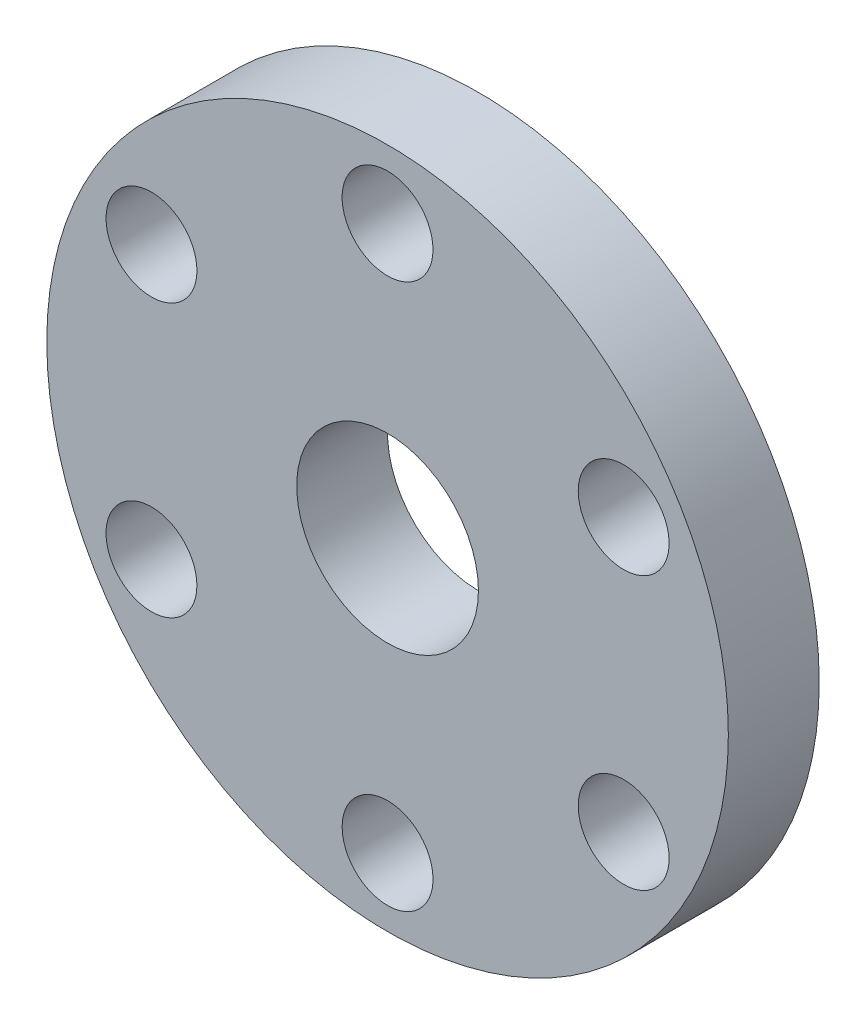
ISO-10303-21;
HEADER;
FILE_DESCRIPTION(('STEP AP214'),'2;1');
FILE_NAME('part.step','',(''),(''),'','','');
FILE_SCHEMA(('AUTOMOTIVE_DESIGN { 1 0 10303 214 1 1 1 1 }'));
ENDSEC;
DATA;
#1=APPLICATION_CONTEXT('core data for automotive mechanical design processes');
#2=APPLICATION_PROTOCOL_DEFINITION('international standard','automotive_design',2000,#1);
#3=PRODUCT_CONTEXT('',#1,'mechanical');
#4=PRODUCT('Part','Part','',(#3));
#5=PRODUCT_RELATED_PRODUCT_CATEGORY('part','',(#4));
#6=PRODUCT_DEFINITION_FORMATION('','',#4);
#7=PRODUCT_DEFINITION_CONTEXT('part definition',#1,'design');
#8=PRODUCT_DEFINITION('design','',#6,#7);
#9=PRODUCT_DEFINITION_SHAPE('','',#8);
#10=(LENGTH_UNIT() NAMED_UNIT(*) SI_UNIT(.MILLI.,.METRE.));
#11=(NAMED_UNIT(*) PLANE_ANGLE_UNIT() SI_UNIT($,.RADIAN.));
#12=(NAMED_UNIT(*) SI_UNIT($,.STERADIAN.) SOLID_ANGLE_UNIT());
#13=UNCERTAINTY_MEASURE_WITH_UNIT(LENGTH_MEASURE(1.E-05),#10,'distance_accuracy_value','');
#14=(GEOMETRIC_REPRESENTATION_CONTEXT(3) GLOBAL_UNCERTAINTY_ASSIGNED_CONTEXT((#13)) GLOBAL_UNIT_ASSIGNED_CONTEXT((#10,
#11,#12)) REPRESENTATION_CONTEXT('',''));
#15=CARTESIAN_POINT('',(0.,0.,0.));
#16=DIRECTION('',(0.,0.,1.));
#17=DIRECTION('',(1.,0.,0.));
#18=AXIS2_PLACEMENT_3D('',#15,#16,#17);
#19=CARTESIAN_POINT('',(0.,0.,20.));
#20=DIRECTION('',(0.,0.,1.));
#21=DIRECTION('',(1.,0.,0.));
#22=AXIS2_PLACEMENT_3D('',#19,#20,#21);
#23=PLANE('',#22);
#24=CARTESIAN_POINT('',(51.961524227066,30.0000000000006,20.));
#25=DIRECTION('',(0.,0.,1.));
#26=DIRECTION('',(0.50000000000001,-0.866025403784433,0.));
#27=AXIS2_PLACEMENT_3D('',#24,#25,#26);
#28=CIRCLE('',#27,10.);
#29=CARTESIAN_POINT('',(56.9615242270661,21.3397459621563,20.));
#30=VERTEX_POINT('',#29);
#31=EDGE_CURVE('E61',#30,#30,#28,.T.);
#32=ORIENTED_EDGE('',*,*,#31,.F.);
#33=EDGE_LOOP('',(#32));
#34=FACE_BOUND('',#33,.T.);
#35=CARTESIAN_POINT('',(51.9615242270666,-29.9999999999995,20.));
#36=DIRECTION('',(0.,0.,1.));
#37=DIRECTION('',(-0.499999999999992,-0.866025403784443,0.));
#38=AXIS2_PLACEMENT_3D('',#35,#36,#37);
#39=CIRCLE('',#38,10.);
#40=CARTESIAN_POINT('',(46.9615242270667,-38.6602540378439,20.));
#41=VERTEX_POINT('',#40);
#42=EDGE_CURVE('E67',#41,#41,#39,.T.);
#43=ORIENTED_EDGE('',*,*,#42,.F.);
#44=EDGE_LOOP('',(#43));
#45=FACE_BOUND('',#44,.T.);
#46=CARTESIAN_POINT('',(0.,-60.,20.));
#47=DIRECTION('',(0.,0.,1.));
#48=DIRECTION('',(-1.,0.,0.));
#49=AXIS2_PLACEMENT_3D('',#46,#47,#48);
#50=CIRCLE('',#49,10.);
#51=CARTESIAN_POINT('',(-10.,-60.,20.));
#52=VERTEX_POINT('',#51);
#53=EDGE_CURVE('E73',#52,#52,#50,.T.);
#54=ORIENTED_EDGE('',*,*,#53,.F.);
#55=EDGE_LOOP('',(#54));
#56=FACE_BOUND('',#55,.T.);
#57=CARTESIAN_POINT('',(-51.9615242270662,-30.0000000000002,20.));
#58=DIRECTION('',(0.,0.,1.));
#59=DIRECTION('',(-0.500000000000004,0.866025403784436,0.));
#60=AXIS2_PLACEMENT_3D('',#57,#58,#59);
#61=CIRCLE('',#60,10.);
#62=CARTESIAN_POINT('',(-56.9615242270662,-21.3397459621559,20.));
#63=VERTEX_POINT('',#62);
#64=EDGE_CURVE('E79',#63,#63,#61,.T.);
#65=ORIENTED_EDGE('',*,*,#64,.F.);
#66=EDGE_LOOP('',(#65));
#67=FACE_BOUND('',#66,.T.);
#68=CARTESIAN_POINT('',(-51.9615242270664,29.9999999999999,20.));
#69=DIRECTION('',(0.,0.,1.));
#70=DIRECTION('',(0.499999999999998,0.86602540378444,0.));
#71=AXIS2_PLACEMENT_3D('',#68,#69,#70);
#72=CIRCLE('',#71,10.);
#73=CARTESIAN_POINT('',(-46.9615242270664,38.6602540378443,20.));
#74=VERTEX_POINT('',#73);
#75=EDGE_CURVE('E55',#74,#74,#72,.T.);
#76=ORIENTED_EDGE('',*,*,#75,.F.);
#77=EDGE_LOOP('',(#76));
#78=FACE_BOUND('',#77,.T.);
#79=CARTESIAN_POINT('',(0.,60.,20.));
#80=DIRECTION('',(0.,0.,1.));
#81=DIRECTION('',(1.,0.,0.));
#82=AXIS2_PLACEMENT_3D('',#79,#80,#81);
#83=CIRCLE('',#82,10.);
#84=CARTESIAN_POINT('',(10.,60.,20.));
#85=VERTEX_POINT('',#84);
#86=EDGE_CURVE('E49',#85,#85,#83,.T.);
#87=ORIENTED_EDGE('',*,*,#86,.F.);
#88=EDGE_LOOP('',(#87));
#89=FACE_BOUND('',#88,.T.);
#90=CARTESIAN_POINT('',(0.,0.,20.));
#91=DIRECTION('',(0.,0.,1.));
#92=DIRECTION('',(1.,0.,0.));
#93=AXIS2_PLACEMENT_3D('',#90,#91,#92);
#94=CIRCLE('',#93,75.);
#95=CARTESIAN_POINT('',(75.,0.,20.));
#96=VERTEX_POINT('',#95);
#97=EDGE_CURVE('E10',#96,#96,#94,.T.);
#98=ORIENTED_EDGE('',*,*,#97,.T.);
#99=EDGE_LOOP('',(#98));
#100=FACE_BOUND('',#99,.T.);
#101=CARTESIAN_POINT('',(0.,0.,20.));
#102=DIRECTION('',(0.,0.,1.));
#103=DIRECTION('',(1.,0.,0.));
#104=AXIS2_PLACEMENT_3D('',#101,#102,#103);
#105=CIRCLE('',#104,20.);
#106=CARTESIAN_POINT('',(20.,0.,20.));
#107=VERTEX_POINT('',#106);
#108=EDGE_CURVE('E41',#107,#107,#105,.T.);
#109=ORIENTED_EDGE('',*,*,#108,.F.);
#110=EDGE_LOOP('',(#109));
#111=FACE_BOUND('',#110,.T.);
#112=ADVANCED_FACE('F30',(#34,#45,#56,#67,#78,#89,#100,#111),#23,.T.);
#113=CARTESIAN_POINT('',(0.,0.,0.));
#114=DIRECTION('',(0.,0.,1.));
#115=DIRECTION('',(1.,0.,0.));
#116=AXIS2_PLACEMENT_3D('',#113,#114,#115);
#117=PLANE('',#116);
#118=CARTESIAN_POINT('',(51.961524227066,30.0000000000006,0.));
#119=DIRECTION('',(0.,0.,1.));
#120=DIRECTION('',(0.50000000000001,-0.866025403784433,0.));
#121=AXIS2_PLACEMENT_3D('',#118,#119,#120);
#122=CIRCLE('',#121,10.);
#123=CARTESIAN_POINT('',(56.9615242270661,21.3397459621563,0.));
#124=VERTEX_POINT('',#123);
#125=EDGE_CURVE('E64',#124,#124,#122,.T.);
#126=ORIENTED_EDGE('',*,*,#125,.T.);
#127=EDGE_LOOP('',(#126));
#128=FACE_BOUND('',#127,.T.);
#129=CARTESIAN_POINT('',(51.9615242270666,-29.9999999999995,0.));
#130=DIRECTION('',(0.,0.,1.));
#131=DIRECTION('',(-0.499999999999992,-0.866025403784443,0.));
#132=AXIS2_PLACEMENT_3D('',#129,#130,#131);
#133=CIRCLE('',#132,10.);
#134=CARTESIAN_POINT('',(46.9615242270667,-38.6602540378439,0.));
#135=VERTEX_POINT('',#134);
#136=EDGE_CURVE('E70',#135,#135,#133,.T.);
#137=ORIENTED_EDGE('',*,*,#136,.T.);
#138=EDGE_LOOP('',(#137));
#139=FACE_BOUND('',#138,.T.);
#140=CARTESIAN_POINT('',(0.,-60.,0.));
#141=DIRECTION('',(0.,0.,1.));
#142=DIRECTION('',(-1.,0.,0.));
#143=AXIS2_PLACEMENT_3D('',#140,#141,#142);
#144=CIRCLE('',#143,10.);
#145=CARTESIAN_POINT('',(-10.,-60.,0.));
#146=VERTEX_POINT('',#145);
#147=EDGE_CURVE('E76',#146,#146,#144,.T.);
#148=ORIENTED_EDGE('',*,*,#147,.T.);
#149=EDGE_LOOP('',(#148));
#150=FACE_BOUND('',#149,.T.);
#151=CARTESIAN_POINT('',(-51.9615242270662,-30.0000000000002,0.));
#152=DIRECTION('',(0.,0.,1.));
#153=DIRECTION('',(-0.500000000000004,0.866025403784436,0.));
#154=AXIS2_PLACEMENT_3D('',#151,#152,#153);
#155=CIRCLE('',#154,10.);
#156=CARTESIAN_POINT('',(-56.9615242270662,-21.3397459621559,0.));
#157=VERTEX_POINT('',#156);
#158=EDGE_CURVE('E58',#157,#157,#155,.T.);
#159=ORIENTED_EDGE('',*,*,#158,.T.);
#160=EDGE_LOOP('',(#159));
#161=FACE_BOUND('',#160,.T.);
#162=CARTESIAN_POINT('',(-51.9615242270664,29.9999999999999,0.));
#163=DIRECTION('',(0.,0.,1.));
#164=DIRECTION('',(0.499999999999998,0.86602540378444,0.));
#165=AXIS2_PLACEMENT_3D('',#162,#163,#164);
#166=CIRCLE('',#165,10.);
#167=CARTESIAN_POINT('',(-46.9615242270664,38.6602540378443,0.));
#168=VERTEX_POINT('',#167);
#169=EDGE_CURVE('E52',#168,#168,#166,.T.);
#170=ORIENTED_EDGE('',*,*,#169,.T.);
#171=EDGE_LOOP('',(#170));
#172=FACE_BOUND('',#171,.T.);
#173=CARTESIAN_POINT('',(0.,60.,0.));
#174=DIRECTION('',(0.,0.,1.));
#175=DIRECTION('',(1.,0.,0.));
#176=AXIS2_PLACEMENT_3D('',#173,#174,#175);
#177=CIRCLE('',#176,10.);
#178=CARTESIAN_POINT('',(10.,60.,0.));
#179=VERTEX_POINT('',#178);
#180=EDGE_CURVE('E46',#179,#179,#177,.T.);
#181=ORIENTED_EDGE('',*,*,#180,.T.);
#182=EDGE_LOOP('',(#181));
#183=FACE_BOUND('',#182,.T.);
#184=CARTESIAN_POINT('',(0.,0.,0.));
#185=DIRECTION('',(0.,0.,1.));
#186=DIRECTION('',(1.,0.,0.));
#187=AXIS2_PLACEMENT_3D('',#184,#185,#186);
#188=CIRCLE('',#187,75.);
#189=CARTESIAN_POINT('',(75.,0.,0.));
#190=VERTEX_POINT('',#189);
#191=EDGE_CURVE('E34',#190,#190,#188,.T.);
#192=ORIENTED_EDGE('',*,*,#191,.F.);
#193=EDGE_LOOP('',(#192));
#194=FACE_BOUND('',#193,.T.);
#195=CARTESIAN_POINT('',(0.,0.,0.));
#196=DIRECTION('',(0.,0.,1.));
#197=DIRECTION('',(1.,0.,0.));
#198=AXIS2_PLACEMENT_3D('',#195,#196,#197);
#199=CIRCLE('',#198,20.);
#200=CARTESIAN_POINT('',(20.,0.,0.));
#201=VERTEX_POINT('',#200);
#202=EDGE_CURVE('E43',#201,#201,#199,.T.);
#203=ORIENTED_EDGE('',*,*,#202,.T.);
#204=EDGE_LOOP('',(#203));
#205=FACE_BOUND('',#204,.T.);
#206=ADVANCED_FACE('F85',(#128,#139,#150,#161,#172,#183,#194,#205),#117,.F.);
#207=CARTESIAN_POINT('',(0.,0.,20.));
#208=DIRECTION('',(0.,0.,-1.));
#209=DIRECTION('',(-1.,0.,0.));
#210=AXIS2_PLACEMENT_3D('',#207,#208,#209);
#211=CYLINDRICAL_SURFACE('',#210,75.);
#212=ORIENTED_EDGE('',*,*,#97,.F.);
#213=EDGE_LOOP('',(#212));
#214=FACE_BOUND('',#213,.T.);
#215=ORIENTED_EDGE('',*,*,#191,.T.);
#216=EDGE_LOOP('',(#215));
#217=FACE_BOUND('',#216,.T.);
#218=ADVANCED_FACE('F32',(#214,#217),#211,.T.);
#219=CARTESIAN_POINT('',(0.,0.,20.));
#220=DIRECTION('',(0.,0.,-1.));
#221=DIRECTION('',(-1.,0.,0.));
#222=AXIS2_PLACEMENT_3D('',#219,#220,#221);
#223=CYLINDRICAL_SURFACE('',#222,20.);
#224=ORIENTED_EDGE('',*,*,#108,.T.);
#225=EDGE_LOOP('',(#224));
#226=FACE_BOUND('',#225,.T.);
#227=ORIENTED_EDGE('',*,*,#202,.F.);
#228=EDGE_LOOP('',(#227));
#229=FACE_BOUND('',#228,.T.);
#230=ADVANCED_FACE('F106',(#226,#229),#223,.F.);
#231=CARTESIAN_POINT('',(0.,60.,0.));
#232=DIRECTION('',(0.,0.,1.));
#233=DIRECTION('',(1.,0.,0.));
#234=AXIS2_PLACEMENT_3D('',#231,#232,#233);
#235=CYLINDRICAL_SURFACE('',#234,10.);
#236=ORIENTED_EDGE('',*,*,#180,.F.);
#237=EDGE_LOOP('',(#236));
#238=FACE_BOUND('',#237,.T.);
#239=ORIENTED_EDGE('',*,*,#86,.T.);
#240=EDGE_LOOP('',(#239));
#241=FACE_BOUND('',#240,.T.);
#242=ADVANCED_FACE('F109',(#238,#241),#235,.F.);
#243=CARTESIAN_POINT('',(-51.9615242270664,29.9999999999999,0.));
#244=DIRECTION('',(0.,0.,1.));
#245=DIRECTION('',(1.,0.,0.));
#246=AXIS2_PLACEMENT_3D('',#243,#244,#245);
#247=CYLINDRICAL_SURFACE('',#246,10.);
#248=ORIENTED_EDGE('',*,*,#169,.F.);
#249=EDGE_LOOP('',(#248));
#250=FACE_BOUND('',#249,.T.);
#251=ORIENTED_EDGE('',*,*,#75,.T.);
#252=EDGE_LOOP('',(#251));
#253=FACE_BOUND('',#252,.T.);
#254=ADVANCED_FACE('F92',(#250,#253),#247,.F.);
#255=CARTESIAN_POINT('',(-51.9615242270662,-30.0000000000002,0.));
#256=DIRECTION('',(0.,0.,1.));
#257=DIRECTION('',(1.,0.,0.));
#258=AXIS2_PLACEMENT_3D('',#255,#256,#257);
#259=CYLINDRICAL_SURFACE('',#258,10.);
#260=ORIENTED_EDGE('',*,*,#158,.F.);
#261=EDGE_LOOP('',(#260));
#262=FACE_BOUND('',#261,.T.);
#263=ORIENTED_EDGE('',*,*,#64,.T.);
#264=EDGE_LOOP('',(#263));
#265=FACE_BOUND('',#264,.T.);
#266=ADVANCED_FACE('F88',(#262,#265),#259,.F.);
#267=CARTESIAN_POINT('',(0.,-60.,0.));
#268=DIRECTION('',(0.,0.,1.));
#269=DIRECTION('',(1.,0.,0.));
#270=AXIS2_PLACEMENT_3D('',#267,#268,#269);
#271=CYLINDRICAL_SURFACE('',#270,10.);
#272=ORIENTED_EDGE('',*,*,#147,.F.);
#273=EDGE_LOOP('',(#272));
#274=FACE_BOUND('',#273,.T.);
#275=ORIENTED_EDGE('',*,*,#53,.T.);
#276=EDGE_LOOP('',(#275));
#277=FACE_BOUND('',#276,.T.);
#278=ADVANCED_FACE('F91',(#274,#277),#271,.F.);
#279=CARTESIAN_POINT('',(51.9615242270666,-29.9999999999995,0.));
#280=DIRECTION('',(0.,0.,1.));
#281=DIRECTION('',(1.,0.,0.));
#282=AXIS2_PLACEMENT_3D('',#279,#280,#281);
#283=CYLINDRICAL_SURFACE('',#282,10.);
#284=ORIENTED_EDGE('',*,*,#136,.F.);
#285=EDGE_LOOP('',(#284));
#286=FACE_BOUND('',#285,.T.);
#287=ORIENTED_EDGE('',*,*,#42,.T.);
#288=EDGE_LOOP('',(#287));
#289=FACE_BOUND('',#288,.T.);
#290=ADVANCED_FACE('F130',(#286,#289),#283,.F.);
#291=CARTESIAN_POINT('',(51.961524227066,30.0000000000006,0.));
#292=DIRECTION('',(0.,0.,1.));
#293=DIRECTION('',(1.,0.,0.));
#294=AXIS2_PLACEMENT_3D('',#291,#292,#293);
#295=CYLINDRICAL_SURFACE('',#294,10.);
#296=ORIENTED_EDGE('',*,*,#125,.F.);
#297=EDGE_LOOP('',(#296));
#298=FACE_BOUND('',#297,.T.);
#299=ORIENTED_EDGE('',*,*,#31,.T.);
#300=EDGE_LOOP('',(#299));
#301=FACE_BOUND('',#300,.T.);
#302=ADVANCED_FACE('F127',(#298,#301),#295,.F.);
#303=CLOSED_SHELL('',(#112,#206,#218,#230,#242,#254,#266,#278,#290,#302));
#304=MANIFOLD_SOLID_BREP('B2',#303);
#305=ADVANCED_BREP_SHAPE_REPRESENTATION('',(#18,#304),#14);
#306=SHAPE_DEFINITION_REPRESENTATION(#9,#305);
ENDSEC;
END-ISO-10303-21;
